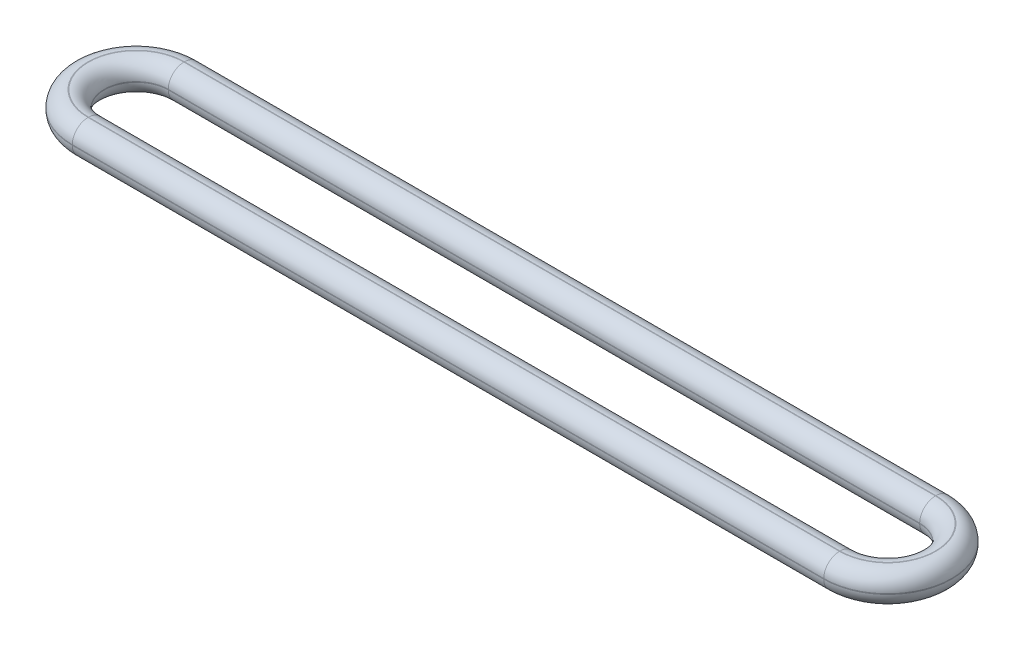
from build123d import *

# Parameters (mm, degrees)
BOSS_EXTRUDE1_DEPTH = 1
FILLET1_R           = 0.49


with BuildPart() as part:
    # Sketch1 → Boss-Extrude1 (new body)
    with BuildSketch(Plane(origin=(0, 0, 0), x_dir=(1, 0, 0), z_dir=(0, 1, 0))):
        with BuildLine():
            Line((0, 2), (23.5, 2))
            ThreePointArc((23.5, 2), (25.5, 0), (23.5, -2))
            Line((23.5, -2), (0, -2))
            ThreePointArc((0, -2), (-2, 0), (0, 2))
        make_face()
        with BuildLine():
            Line((0, 1), (23.5, 1))
            ThreePointArc((23.5, 1), (24.5, 0), (23.5, -1))
            Line((23.5, -1), (0, -1))
            ThreePointArc((0, -1), (-1, 0), (0, 1))
        make_face(mode=Mode.SUBTRACT)
    extrude(amount=BOSS_EXTRUDE1_DEPTH)

    # Fillet1
    fillet1_edges = [part.edges().sort_by_distance(p)[0] for p in [
        (25.5, 1, 0),
        (11.75, 1, -2),
        (-1, 0, 0),
        (11.75, 0, 1),
        (24.5, 0, 0),
        (11.75, 0, -1),
        (-1, 1, 0),
        (11.75, 1, 1),
        (24.5, 1, 0),
        (11.75, 1, -1),
        (-2, 1, 0),
        (11.75, 0, -2),
        (25.5, 0, 0),
        (11.75, 0, 2),
        (-2, 0, 0),
        (11.75, 1, 2),
    ]]
    fillet(fillet1_edges, radius=FILLET1_R)


solid = part.part
